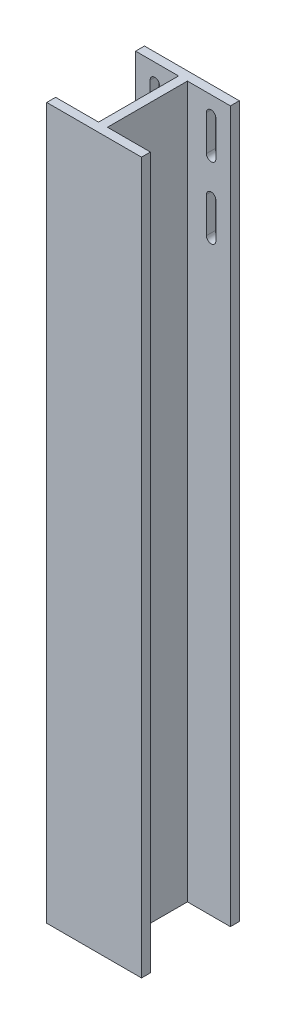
ISO-10303-21;
HEADER;
FILE_DESCRIPTION(('STEP AP214'),'2;1');
FILE_NAME('part.step','',(''),(''),'','','');
FILE_SCHEMA(('AUTOMOTIVE_DESIGN { 1 0 10303 214 1 1 1 1 }'));
ENDSEC;
DATA;
#1=APPLICATION_CONTEXT('core data for automotive mechanical design processes');
#2=APPLICATION_PROTOCOL_DEFINITION('international standard','automotive_design',2000,#1);
#3=PRODUCT_CONTEXT('',#1,'mechanical');
#4=PRODUCT('Part','Part','',(#3));
#5=PRODUCT_RELATED_PRODUCT_CATEGORY('part','',(#4));
#6=PRODUCT_DEFINITION_FORMATION('','',#4);
#7=PRODUCT_DEFINITION_CONTEXT('part definition',#1,'design');
#8=PRODUCT_DEFINITION('design','',#6,#7);
#9=PRODUCT_DEFINITION_SHAPE('','',#8);
#10=(LENGTH_UNIT() NAMED_UNIT(*) SI_UNIT(.MILLI.,.METRE.));
#11=(NAMED_UNIT(*) PLANE_ANGLE_UNIT() SI_UNIT($,.RADIAN.));
#12=(NAMED_UNIT(*) SI_UNIT($,.STERADIAN.) SOLID_ANGLE_UNIT());
#13=UNCERTAINTY_MEASURE_WITH_UNIT(LENGTH_MEASURE(1.E-05),#10,'distance_accuracy_value','');
#14=(GEOMETRIC_REPRESENTATION_CONTEXT(3) GLOBAL_UNCERTAINTY_ASSIGNED_CONTEXT((#13)) GLOBAL_UNIT_ASSIGNED_CONTEXT((#10,
#11,#12)) REPRESENTATION_CONTEXT('',''));
#15=CARTESIAN_POINT('',(0.,0.,0.));
#16=DIRECTION('',(0.,0.,1.));
#17=DIRECTION('',(1.,0.,0.));
#18=AXIS2_PLACEMENT_3D('',#15,#16,#17);
#19=CARTESIAN_POINT('',(0.,762.,0.));
#20=DIRECTION('',(1.,0.,0.));
#21=DIRECTION('',(0.,0.,-1.));
#22=AXIS2_PLACEMENT_3D('',#19,#20,#21);
#23=PLANE('',#22);
#24=DIRECTION('',(0.,0.,1.));
#25=VECTOR('',#24,1.);
#26=CARTESIAN_POINT('',(0.,0.,0.));
#27=LINE('',#26,#25);
#28=CARTESIAN_POINT('',(0.,0.,-9.525));
#29=VERTEX_POINT('',#28);
#30=CARTESIAN_POINT('',(0.,0.,0.));
#31=VERTEX_POINT('',#30);
#32=EDGE_CURVE('E316',#29,#31,#27,.T.);
#33=ORIENTED_EDGE('',*,*,#32,.T.);
#34=DIRECTION('',(0.,-1.,0.));
#35=VECTOR('',#34,1.);
#36=CARTESIAN_POINT('',(0.,762.,0.));
#37=LINE('',#36,#35);
#38=CARTESIAN_POINT('',(0.,762.,0.));
#39=VERTEX_POINT('',#38);
#40=EDGE_CURVE('E395',#39,#31,#37,.T.);
#41=ORIENTED_EDGE('',*,*,#40,.F.);
#42=DIRECTION('',(0.,0.,1.));
#43=VECTOR('',#42,1.);
#44=CARTESIAN_POINT('',(0.,762.,0.));
#45=LINE('',#44,#43);
#46=CARTESIAN_POINT('',(0.,762.,-9.525));
#47=VERTEX_POINT('',#46);
#48=EDGE_CURVE('E266',#47,#39,#45,.T.);
#49=ORIENTED_EDGE('',*,*,#48,.F.);
#50=DIRECTION('',(0.,-1.,0.));
#51=VECTOR('',#50,1.);
#52=CARTESIAN_POINT('',(0.,762.,-9.525));
#53=LINE('',#52,#51);
#54=EDGE_CURVE('E315',#47,#29,#53,.T.);
#55=ORIENTED_EDGE('',*,*,#54,.T.);
#56=EDGE_LOOP('',(#33,#41,#49,#55));
#57=FACE_BOUND('',#56,.T.);
#58=ADVANCED_FACE('F38',(#57),#23,.F.);
#59=CARTESIAN_POINT('',(0.,762.,0.));
#60=DIRECTION('',(0.,0.,-1.));
#61=DIRECTION('',(-1.,0.,0.));
#62=AXIS2_PLACEMENT_3D('',#59,#60,#61);
#63=PLANE('',#62);
#64=DIRECTION('',(1.,0.,0.));
#65=VECTOR('',#64,1.);
#66=CARTESIAN_POINT('',(0.,0.,0.));
#67=LINE('',#66,#65);
#68=CARTESIAN_POINT('',(101.6,0.,0.));
#69=VERTEX_POINT('',#68);
#70=EDGE_CURVE('E115',#31,#69,#67,.T.);
#71=ORIENTED_EDGE('',*,*,#70,.T.);
#72=DIRECTION('',(0.,-1.,0.));
#73=VECTOR('',#72,1.);
#74=CARTESIAN_POINT('',(101.6,762.,0.));
#75=LINE('',#74,#73);
#76=CARTESIAN_POINT('',(101.6,762.,0.));
#77=VERTEX_POINT('',#76);
#78=EDGE_CURVE('E391',#77,#69,#75,.T.);
#79=ORIENTED_EDGE('',*,*,#78,.F.);
#80=DIRECTION('',(1.,0.,0.));
#81=VECTOR('',#80,1.);
#82=CARTESIAN_POINT('',(0.,762.,0.));
#83=LINE('',#82,#81);
#84=EDGE_CURVE('E270',#39,#77,#83,.T.);
#85=ORIENTED_EDGE('',*,*,#84,.F.);
#86=ORIENTED_EDGE('',*,*,#40,.T.);
#87=EDGE_LOOP('',(#71,#79,#85,#86));
#88=FACE_BOUND('',#87,.T.);
#89=ADVANCED_FACE('F511',(#88),#63,.F.);
#90=CARTESIAN_POINT('',(101.6,762.,0.));
#91=DIRECTION('',(-1.,0.,0.));
#92=DIRECTION('',(0.,0.,1.));
#93=AXIS2_PLACEMENT_3D('',#90,#91,#92);
#94=PLANE('',#93);
#95=DIRECTION('',(0.,0.,-1.));
#96=VECTOR('',#95,1.);
#97=CARTESIAN_POINT('',(101.6,0.,0.));
#98=LINE('',#97,#96);
#99=CARTESIAN_POINT('',(101.6,0.,-9.525));
#100=VERTEX_POINT('',#99);
#101=EDGE_CURVE('E323',#69,#100,#98,.T.);
#102=ORIENTED_EDGE('',*,*,#101,.T.);
#103=DIRECTION('',(0.,-1.,0.));
#104=VECTOR('',#103,1.);
#105=CARTESIAN_POINT('',(101.6,762.,-9.525));
#106=LINE('',#105,#104);
#107=CARTESIAN_POINT('',(101.6,762.,-9.525));
#108=VERTEX_POINT('',#107);
#109=EDGE_CURVE('E387',#108,#100,#106,.T.);
#110=ORIENTED_EDGE('',*,*,#109,.F.);
#111=DIRECTION('',(0.,0.,-1.));
#112=VECTOR('',#111,1.);
#113=CARTESIAN_POINT('',(101.6,762.,0.));
#114=LINE('',#113,#112);
#115=EDGE_CURVE('E275',#77,#108,#114,.T.);
#116=ORIENTED_EDGE('',*,*,#115,.F.);
#117=ORIENTED_EDGE('',*,*,#78,.T.);
#118=EDGE_LOOP('',(#102,#110,#116,#117));
#119=FACE_BOUND('',#118,.T.);
#120=ADVANCED_FACE('F518',(#119),#94,.F.);
#121=CARTESIAN_POINT('',(101.6,762.,-9.525));
#122=DIRECTION('',(0.,0.,1.));
#123=DIRECTION('',(1.,0.,0.));
#124=AXIS2_PLACEMENT_3D('',#121,#122,#123);
#125=PLANE('',#124);
#126=DIRECTION('',(-1.,0.,0.));
#127=VECTOR('',#126,1.);
#128=CARTESIAN_POINT('',(101.6,0.,-9.525));
#129=LINE('',#128,#127);
#130=CARTESIAN_POINT('',(55.5625,0.,-9.525));
#131=VERTEX_POINT('',#130);
#132=EDGE_CURVE('E326',#100,#131,#129,.T.);
#133=ORIENTED_EDGE('',*,*,#132,.T.);
#134=DIRECTION('',(0.,-1.,0.));
#135=VECTOR('',#134,1.);
#136=CARTESIAN_POINT('',(55.5625,762.,-9.525));
#137=LINE('',#136,#135);
#138=CARTESIAN_POINT('',(55.5625,762.,-9.525));
#139=VERTEX_POINT('',#138);
#140=EDGE_CURVE('E383',#139,#131,#137,.T.);
#141=ORIENTED_EDGE('',*,*,#140,.F.);
#142=DIRECTION('',(-1.,0.,0.));
#143=VECTOR('',#142,1.);
#144=CARTESIAN_POINT('',(101.6,762.,-9.525));
#145=LINE('',#144,#143);
#146=EDGE_CURVE('E279',#108,#139,#145,.T.);
#147=ORIENTED_EDGE('',*,*,#146,.F.);
#148=ORIENTED_EDGE('',*,*,#109,.T.);
#149=EDGE_LOOP('',(#133,#141,#147,#148));
#150=FACE_BOUND('',#149,.T.);
#151=ADVANCED_FACE('F521',(#150),#125,.F.);
#152=CARTESIAN_POINT('',(55.5625,762.,-9.525));
#153=DIRECTION('',(-1.,0.,0.));
#154=DIRECTION('',(0.,0.,1.));
#155=AXIS2_PLACEMENT_3D('',#152,#153,#154);
#156=PLANE('',#155);
#157=DIRECTION('',(0.,0.,-1.));
#158=VECTOR('',#157,1.);
#159=CARTESIAN_POINT('',(55.5625,0.,-9.525));
#160=LINE('',#159,#158);
#161=CARTESIAN_POINT('',(55.5625,0.,-95.25));
#162=VERTEX_POINT('',#161);
#163=EDGE_CURVE('E329',#131,#162,#160,.T.);
#164=ORIENTED_EDGE('',*,*,#163,.T.);
#165=DIRECTION('',(0.,-1.,0.));
#166=VECTOR('',#165,1.);
#167=CARTESIAN_POINT('',(55.5625,762.,-95.25));
#168=LINE('',#167,#166);
#169=CARTESIAN_POINT('',(55.5625,762.,-95.25));
#170=VERTEX_POINT('',#169);
#171=EDGE_CURVE('E379',#170,#162,#168,.T.);
#172=ORIENTED_EDGE('',*,*,#171,.F.);
#173=DIRECTION('',(0.,0.,-1.));
#174=VECTOR('',#173,1.);
#175=CARTESIAN_POINT('',(55.5625,762.,-9.525));
#176=LINE('',#175,#174);
#177=EDGE_CURVE('E283',#139,#170,#176,.T.);
#178=ORIENTED_EDGE('',*,*,#177,.F.);
#179=ORIENTED_EDGE('',*,*,#140,.T.);
#180=EDGE_LOOP('',(#164,#172,#178,#179));
#181=FACE_BOUND('',#180,.T.);
#182=ADVANCED_FACE('F526',(#181),#156,.F.);
#183=CARTESIAN_POINT('',(101.6,762.,-95.25));
#184=DIRECTION('',(0.,0.,-1.));
#185=DIRECTION('',(-1.,0.,0.));
#186=AXIS2_PLACEMENT_3D('',#183,#184,#185);
#187=PLANE('',#186);
#188=CARTESIAN_POINT('',(80.9625,628.65,-95.25));
#189=DIRECTION('',(0.,0.,-1.));
#190=DIRECTION('',(-1.,0.,0.));
#191=AXIS2_PLACEMENT_3D('',#188,#189,#190);
#192=CIRCLE('',#191,5.04189999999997);
#193=CARTESIAN_POINT('',(75.9206,628.65,-95.25));
#194=VERTEX_POINT('',#193);
#195=CARTESIAN_POINT('',(86.0044,628.65,-95.25));
#196=VERTEX_POINT('',#195);
#197=EDGE_CURVE('E210',#194,#196,#192,.F.);
#198=ORIENTED_EDGE('',*,*,#197,.F.);
#199=DIRECTION('',(0.,-1.,0.));
#200=VECTOR('',#199,1.);
#201=CARTESIAN_POINT('',(75.9206,628.65,-95.25));
#202=LINE('',#201,#200);
#203=CARTESIAN_POINT('',(75.9206,666.75,-95.25));
#204=VERTEX_POINT('',#203);
#205=EDGE_CURVE('E55',#204,#194,#202,.T.);
#206=ORIENTED_EDGE('',*,*,#205,.F.);
#207=CARTESIAN_POINT('',(80.9625,666.75,-95.25));
#208=DIRECTION('',(0.,0.,-1.));
#209=DIRECTION('',(-1.,0.,0.));
#210=AXIS2_PLACEMENT_3D('',#207,#208,#209);
#211=CIRCLE('',#210,5.04189999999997);
#212=CARTESIAN_POINT('',(86.0044,666.75,-95.25));
#213=VERTEX_POINT('',#212);
#214=EDGE_CURVE('E218',#213,#204,#211,.F.);
#215=ORIENTED_EDGE('',*,*,#214,.F.);
#216=DIRECTION('',(0.,1.,0.));
#217=VECTOR('',#216,1.);
#218=CARTESIAN_POINT('',(86.0044,628.65,-95.25));
#219=LINE('',#218,#217);
#220=EDGE_CURVE('E214',#196,#213,#219,.T.);
#221=ORIENTED_EDGE('',*,*,#220,.F.);
#222=EDGE_LOOP('',(#198,#206,#215,#221));
#223=FACE_BOUND('',#222,.T.);
#224=CARTESIAN_POINT('',(80.9625,742.95,-95.25));
#225=DIRECTION('',(0.,0.,-1.));
#226=DIRECTION('',(-1.,0.,0.));
#227=AXIS2_PLACEMENT_3D('',#224,#225,#226);
#228=CIRCLE('',#227,5.04189999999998);
#229=CARTESIAN_POINT('',(86.0044,742.95,-95.25));
#230=VERTEX_POINT('',#229);
#231=CARTESIAN_POINT('',(75.9206,742.95,-95.25));
#232=VERTEX_POINT('',#231);
#233=EDGE_CURVE('E237',#230,#232,#228,.F.);
#234=ORIENTED_EDGE('',*,*,#233,.F.);
#235=DIRECTION('',(0.,1.,0.));
#236=VECTOR('',#235,1.);
#237=CARTESIAN_POINT('',(86.0044,742.95,-95.25));
#238=LINE('',#237,#236);
#239=CARTESIAN_POINT('',(86.0044,704.85,-95.25));
#240=VERTEX_POINT('',#239);
#241=EDGE_CURVE('E234',#240,#230,#238,.T.);
#242=ORIENTED_EDGE('',*,*,#241,.F.);
#243=CARTESIAN_POINT('',(80.9625,704.85,-95.25));
#244=DIRECTION('',(0.,0.,-1.));
#245=DIRECTION('',(-1.,0.,0.));
#246=AXIS2_PLACEMENT_3D('',#243,#244,#245);
#247=CIRCLE('',#246,5.04189999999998);
#248=CARTESIAN_POINT('',(75.9206,704.85,-95.25));
#249=VERTEX_POINT('',#248);
#250=EDGE_CURVE('E246',#249,#240,#247,.F.);
#251=ORIENTED_EDGE('',*,*,#250,.F.);
#252=DIRECTION('',(0.,-1.,0.));
#253=VECTOR('',#252,1.);
#254=CARTESIAN_POINT('',(75.9206,742.95,-95.25));
#255=LINE('',#254,#253);
#256=EDGE_CURVE('E242',#232,#249,#255,.T.);
#257=ORIENTED_EDGE('',*,*,#256,.F.);
#258=EDGE_LOOP('',(#234,#242,#251,#257));
#259=FACE_BOUND('',#258,.T.);
#260=DIRECTION('',(1.,0.,0.));
#261=VECTOR('',#260,1.);
#262=CARTESIAN_POINT('',(101.6,0.,-95.25));
#263=LINE('',#262,#261);
#264=CARTESIAN_POINT('',(101.6,0.,-95.25));
#265=VERTEX_POINT('',#264);
#266=EDGE_CURVE('E332',#162,#265,#263,.T.);
#267=ORIENTED_EDGE('',*,*,#266,.T.);
#268=DIRECTION('',(0.,-1.,0.));
#269=VECTOR('',#268,1.);
#270=CARTESIAN_POINT('',(101.6,762.,-95.25));
#271=LINE('',#270,#269);
#272=CARTESIAN_POINT('',(101.6,762.,-95.25));
#273=VERTEX_POINT('',#272);
#274=EDGE_CURVE('E375',#273,#265,#271,.T.);
#275=ORIENTED_EDGE('',*,*,#274,.F.);
#276=DIRECTION('',(1.,0.,0.));
#277=VECTOR('',#276,1.);
#278=CARTESIAN_POINT('',(101.6,762.,-95.25));
#279=LINE('',#278,#277);
#280=EDGE_CURVE('E287',#170,#273,#279,.T.);
#281=ORIENTED_EDGE('',*,*,#280,.F.);
#282=ORIENTED_EDGE('',*,*,#171,.T.);
#283=EDGE_LOOP('',(#267,#275,#281,#282));
#284=FACE_BOUND('',#283,.T.);
#285=ADVANCED_FACE('F464',(#223,#259,#284),#187,.F.);
#286=CARTESIAN_POINT('',(101.6,762.,-104.775));
#287=DIRECTION('',(-1.,0.,0.));
#288=DIRECTION('',(0.,0.,1.));
#289=AXIS2_PLACEMENT_3D('',#286,#287,#288);
#290=PLANE('',#289);
#291=DIRECTION('',(0.,0.,-1.));
#292=VECTOR('',#291,1.);
#293=CARTESIAN_POINT('',(101.6,0.,-104.775));
#294=LINE('',#293,#292);
#295=CARTESIAN_POINT('',(101.6,0.,-104.775));
#296=VERTEX_POINT('',#295);
#297=EDGE_CURVE('E335',#265,#296,#294,.T.);
#298=ORIENTED_EDGE('',*,*,#297,.T.);
#299=DIRECTION('',(0.,-1.,0.));
#300=VECTOR('',#299,1.);
#301=CARTESIAN_POINT('',(101.6,762.,-104.775));
#302=LINE('',#301,#300);
#303=CARTESIAN_POINT('',(101.6,762.,-104.775));
#304=VERTEX_POINT('',#303);
#305=EDGE_CURVE('E371',#304,#296,#302,.T.);
#306=ORIENTED_EDGE('',*,*,#305,.F.);
#307=DIRECTION('',(0.,0.,-1.));
#308=VECTOR('',#307,1.);
#309=CARTESIAN_POINT('',(101.6,762.,-104.775));
#310=LINE('',#309,#308);
#311=EDGE_CURVE('E291',#273,#304,#310,.T.);
#312=ORIENTED_EDGE('',*,*,#311,.F.);
#313=ORIENTED_EDGE('',*,*,#274,.T.);
#314=EDGE_LOOP('',(#298,#306,#312,#313));
#315=FACE_BOUND('',#314,.T.);
#316=ADVANCED_FACE('F535',(#315),#290,.F.);
#317=CARTESIAN_POINT('',(0.,762.,-104.775));
#318=DIRECTION('',(0.,0.,1.));
#319=DIRECTION('',(1.,0.,0.));
#320=AXIS2_PLACEMENT_3D('',#317,#318,#319);
#321=PLANE('',#320);
#322=CARTESIAN_POINT('',(80.9625,666.75,-104.775));
#323=DIRECTION('',(0.,0.,-1.));
#324=DIRECTION('',(-1.,0.,0.));
#325=AXIS2_PLACEMENT_3D('',#322,#323,#324);
#326=CIRCLE('',#325,5.04189999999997);
#327=CARTESIAN_POINT('',(86.0044,666.75,-104.775));
#328=VERTEX_POINT('',#327);
#329=CARTESIAN_POINT('',(75.9206,666.75,-104.775));
#330=VERTEX_POINT('',#329);
#331=EDGE_CURVE('E47',#328,#330,#326,.F.);
#332=ORIENTED_EDGE('',*,*,#331,.T.);
#333=DIRECTION('',(0.,1.,0.));
#334=VECTOR('',#333,1.);
#335=CARTESIAN_POINT('',(75.9206,762.,-104.775));
#336=LINE('',#335,#334);
#337=CARTESIAN_POINT('',(75.9206,628.65,-104.775));
#338=VERTEX_POINT('',#337);
#339=EDGE_CURVE('E11',#330,#338,#336,.F.);
#340=ORIENTED_EDGE('',*,*,#339,.T.);
#341=CARTESIAN_POINT('',(80.9625,628.65,-104.775));
#342=DIRECTION('',(0.,0.,-1.));
#343=DIRECTION('',(-1.,0.,0.));
#344=AXIS2_PLACEMENT_3D('',#341,#342,#343);
#345=CIRCLE('',#344,5.04189999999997);
#346=CARTESIAN_POINT('',(86.0044,628.65,-104.775));
#347=VERTEX_POINT('',#346);
#348=EDGE_CURVE('E414',#338,#347,#345,.F.);
#349=ORIENTED_EDGE('',*,*,#348,.T.);
#350=DIRECTION('',(0.,1.,0.));
#351=VECTOR('',#350,1.);
#352=CARTESIAN_POINT('',(86.0044,762.,-104.775));
#353=LINE('',#352,#351);
#354=EDGE_CURVE('E441',#347,#328,#353,.T.);
#355=ORIENTED_EDGE('',*,*,#354,.T.);
#356=EDGE_LOOP('',(#332,#340,#349,#355));
#357=FACE_BOUND('',#356,.T.);
#358=DIRECTION('',(0.,1.,0.));
#359=VECTOR('',#358,1.);
#360=CARTESIAN_POINT('',(15.5956,628.65,-104.775));
#361=LINE('',#360,#359);
#362=CARTESIAN_POINT('',(15.5956,628.65,-104.775));
#363=VERTEX_POINT('',#362);
#364=CARTESIAN_POINT('',(15.5956,666.75,-104.775));
#365=VERTEX_POINT('',#364);
#366=EDGE_CURVE('E183',#363,#365,#361,.T.);
#367=ORIENTED_EDGE('',*,*,#366,.F.);
#368=CARTESIAN_POINT('',(20.6375,628.65,-104.775));
#369=DIRECTION('',(0.,0.,-1.));
#370=DIRECTION('',(-1.,0.,0.));
#371=AXIS2_PLACEMENT_3D('',#368,#369,#370);
#372=CIRCLE('',#371,5.0419);
#373=CARTESIAN_POINT('',(25.6794,628.65,-104.775));
#374=VERTEX_POINT('',#373);
#375=EDGE_CURVE('E320',#374,#363,#372,.T.);
#376=ORIENTED_EDGE('',*,*,#375,.F.);
#377=DIRECTION('',(0.,1.,0.));
#378=VECTOR('',#377,1.);
#379=CARTESIAN_POINT('',(25.6794,628.65,-104.775));
#380=LINE('',#379,#378);
#381=CARTESIAN_POINT('',(25.6794,666.75,-104.775));
#382=VERTEX_POINT('',#381);
#383=EDGE_CURVE('E432',#382,#374,#380,.F.);
#384=ORIENTED_EDGE('',*,*,#383,.F.);
#385=CARTESIAN_POINT('',(20.6375,666.75,-104.775));
#386=DIRECTION('',(0.,0.,-1.));
#387=DIRECTION('',(-1.,0.,0.));
#388=AXIS2_PLACEMENT_3D('',#385,#386,#387);
#389=CIRCLE('',#388,5.0419);
#390=EDGE_CURVE('E429',#365,#382,#389,.T.);
#391=ORIENTED_EDGE('',*,*,#390,.F.);
#392=EDGE_LOOP('',(#367,#376,#384,#391));
#393=FACE_BOUND('',#392,.T.);
#394=DIRECTION('',(0.,1.,0.));
#395=VECTOR('',#394,1.);
#396=CARTESIAN_POINT('',(15.5956,704.85,-104.775));
#397=LINE('',#396,#395);
#398=CARTESIAN_POINT('',(15.5956,704.85,-104.775));
#399=VERTEX_POINT('',#398);
#400=CARTESIAN_POINT('',(15.5956,742.95,-104.775));
#401=VERTEX_POINT('',#400);
#402=EDGE_CURVE('E255',#399,#401,#397,.T.);
#403=ORIENTED_EDGE('',*,*,#402,.F.);
#404=CARTESIAN_POINT('',(20.6375,704.85,-104.775));
#405=DIRECTION('',(0.,0.,-1.));
#406=DIRECTION('',(-1.,0.,0.));
#407=AXIS2_PLACEMENT_3D('',#404,#405,#406);
#408=CIRCLE('',#407,5.0419);
#409=CARTESIAN_POINT('',(25.6794,704.85,-104.775));
#410=VERTEX_POINT('',#409);
#411=EDGE_CURVE('E423',#410,#399,#408,.T.);
#412=ORIENTED_EDGE('',*,*,#411,.F.);
#413=DIRECTION('',(0.,1.,0.));
#414=VECTOR('',#413,1.);
#415=CARTESIAN_POINT('',(25.6794,704.85,-104.775));
#416=LINE('',#415,#414);
#417=CARTESIAN_POINT('',(25.6794,742.95,-104.775));
#418=VERTEX_POINT('',#417);
#419=EDGE_CURVE('E420',#418,#410,#416,.F.);
#420=ORIENTED_EDGE('',*,*,#419,.F.);
#421=CARTESIAN_POINT('',(20.6375,742.95,-104.775));
#422=DIRECTION('',(0.,0.,-1.));
#423=DIRECTION('',(-1.,0.,0.));
#424=AXIS2_PLACEMENT_3D('',#421,#422,#423);
#425=CIRCLE('',#424,5.0419);
#426=EDGE_CURVE('E417',#401,#418,#425,.T.);
#427=ORIENTED_EDGE('',*,*,#426,.F.);
#428=EDGE_LOOP('',(#403,#412,#420,#427));
#429=FACE_BOUND('',#428,.T.);
#430=CARTESIAN_POINT('',(80.9625,704.85,-104.775));
#431=DIRECTION('',(0.,0.,-1.));
#432=DIRECTION('',(-1.,0.,0.));
#433=AXIS2_PLACEMENT_3D('',#430,#431,#432);
#434=CIRCLE('',#433,5.04189999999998);
#435=CARTESIAN_POINT('',(75.9206,704.85,-104.775));
#436=VERTEX_POINT('',#435);
#437=CARTESIAN_POINT('',(86.0044,704.85,-104.775));
#438=VERTEX_POINT('',#437);
#439=EDGE_CURVE('E406',#436,#438,#434,.F.);
#440=ORIENTED_EDGE('',*,*,#439,.T.);
#441=DIRECTION('',(0.,1.,0.));
#442=VECTOR('',#441,1.);
#443=CARTESIAN_POINT('',(86.0044,762.,-104.775));
#444=LINE('',#443,#442);
#445=CARTESIAN_POINT('',(86.0044,742.95,-104.775));
#446=VERTEX_POINT('',#445);
#447=EDGE_CURVE('E410',#438,#446,#444,.T.);
#448=ORIENTED_EDGE('',*,*,#447,.T.);
#449=CARTESIAN_POINT('',(80.9625,742.95,-104.775));
#450=DIRECTION('',(0.,0.,-1.));
#451=DIRECTION('',(-1.,0.,0.));
#452=AXIS2_PLACEMENT_3D('',#449,#450,#451);
#453=CIRCLE('',#452,5.04189999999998);
#454=CARTESIAN_POINT('',(75.9206,742.95,-104.775));
#455=VERTEX_POINT('',#454);
#456=EDGE_CURVE('E398',#446,#455,#453,.F.);
#457=ORIENTED_EDGE('',*,*,#456,.T.);
#458=DIRECTION('',(0.,1.,0.));
#459=VECTOR('',#458,1.);
#460=CARTESIAN_POINT('',(75.9206,762.,-104.775));
#461=LINE('',#460,#459);
#462=EDGE_CURVE('E402',#455,#436,#461,.F.);
#463=ORIENTED_EDGE('',*,*,#462,.T.);
#464=EDGE_LOOP('',(#440,#448,#457,#463));
#465=FACE_BOUND('',#464,.T.);
#466=DIRECTION('',(-1.,0.,0.));
#467=VECTOR('',#466,1.);
#468=CARTESIAN_POINT('',(0.,0.,-104.775));
#469=LINE('',#468,#467);
#470=CARTESIAN_POINT('',(0.,0.,-104.775));
#471=VERTEX_POINT('',#470);
#472=EDGE_CURVE('E338',#296,#471,#469,.T.);
#473=ORIENTED_EDGE('',*,*,#472,.T.);
#474=DIRECTION('',(0.,-1.,0.));
#475=VECTOR('',#474,1.);
#476=CARTESIAN_POINT('',(0.,762.,-104.775));
#477=LINE('',#476,#475);
#478=CARTESIAN_POINT('',(0.,762.,-104.775));
#479=VERTEX_POINT('',#478);
#480=EDGE_CURVE('E367',#479,#471,#477,.T.);
#481=ORIENTED_EDGE('',*,*,#480,.F.);
#482=DIRECTION('',(-1.,0.,0.));
#483=VECTOR('',#482,1.);
#484=CARTESIAN_POINT('',(0.,762.,-104.775));
#485=LINE('',#484,#483);
#486=EDGE_CURVE('E295',#304,#479,#485,.T.);
#487=ORIENTED_EDGE('',*,*,#486,.F.);
#488=ORIENTED_EDGE('',*,*,#305,.T.);
#489=EDGE_LOOP('',(#473,#481,#487,#488));
#490=FACE_BOUND('',#489,.T.);
#491=ADVANCED_FACE('F447',(#357,#393,#429,#465,#490),#321,.F.);
#492=CARTESIAN_POINT('',(0.,762.,-104.775));
#493=DIRECTION('',(1.,0.,0.));
#494=DIRECTION('',(0.,0.,-1.));
#495=AXIS2_PLACEMENT_3D('',#492,#493,#494);
#496=PLANE('',#495);
#497=DIRECTION('',(0.,0.,1.));
#498=VECTOR('',#497,1.);
#499=CARTESIAN_POINT('',(0.,0.,-104.775));
#500=LINE('',#499,#498);
#501=CARTESIAN_POINT('',(0.,0.,-95.25));
#502=VERTEX_POINT('',#501);
#503=EDGE_CURVE('E341',#471,#502,#500,.T.);
#504=ORIENTED_EDGE('',*,*,#503,.T.);
#505=DIRECTION('',(0.,-1.,0.));
#506=VECTOR('',#505,1.);
#507=CARTESIAN_POINT('',(0.,762.,-95.25));
#508=LINE('',#507,#506);
#509=CARTESIAN_POINT('',(0.,762.,-95.25));
#510=VERTEX_POINT('',#509);
#511=EDGE_CURVE('E363',#510,#502,#508,.T.);
#512=ORIENTED_EDGE('',*,*,#511,.F.);
#513=DIRECTION('',(0.,0.,1.));
#514=VECTOR('',#513,1.);
#515=CARTESIAN_POINT('',(0.,762.,-104.775));
#516=LINE('',#515,#514);
#517=EDGE_CURVE('E299',#479,#510,#516,.T.);
#518=ORIENTED_EDGE('',*,*,#517,.F.);
#519=ORIENTED_EDGE('',*,*,#480,.T.);
#520=EDGE_LOOP('',(#504,#512,#518,#519));
#521=FACE_BOUND('',#520,.T.);
#522=ADVANCED_FACE('F545',(#521),#496,.F.);
#523=CARTESIAN_POINT('',(0.,762.,-95.25));
#524=DIRECTION('',(0.,0.,-1.));
#525=DIRECTION('',(-1.,0.,0.));
#526=AXIS2_PLACEMENT_3D('',#523,#524,#525);
#527=PLANE('',#526);
#528=DIRECTION('',(0.,1.,0.));
#529=VECTOR('',#528,1.);
#530=CARTESIAN_POINT('',(25.6794,628.65,-95.25));
#531=LINE('',#530,#529);
#532=CARTESIAN_POINT('',(25.6794,628.65,-95.25));
#533=VERTEX_POINT('',#532);
#534=CARTESIAN_POINT('',(25.6794,666.75,-95.25));
#535=VERTEX_POINT('',#534);
#536=EDGE_CURVE('E173',#533,#535,#531,.T.);
#537=ORIENTED_EDGE('',*,*,#536,.F.);
#538=CARTESIAN_POINT('',(20.6375,628.65,-95.25));
#539=DIRECTION('',(0.,0.,-1.));
#540=DIRECTION('',(-1.,0.,0.));
#541=AXIS2_PLACEMENT_3D('',#538,#539,#540);
#542=CIRCLE('',#541,5.0419);
#543=CARTESIAN_POINT('',(15.5956,628.65,-95.25));
#544=VERTEX_POINT('',#543);
#545=EDGE_CURVE('E190',#544,#533,#542,.F.);
#546=ORIENTED_EDGE('',*,*,#545,.F.);
#547=DIRECTION('',(0.,-1.,0.));
#548=VECTOR('',#547,1.);
#549=CARTESIAN_POINT('',(15.5956,628.65,-95.25));
#550=LINE('',#549,#548);
#551=CARTESIAN_POINT('',(15.5956,666.75,-95.25));
#552=VERTEX_POINT('',#551);
#553=EDGE_CURVE('E180',#552,#544,#550,.T.);
#554=ORIENTED_EDGE('',*,*,#553,.F.);
#555=CARTESIAN_POINT('',(20.6375,666.75,-95.25));
#556=DIRECTION('',(0.,0.,-1.));
#557=DIRECTION('',(-1.,0.,0.));
#558=AXIS2_PLACEMENT_3D('',#555,#556,#557);
#559=CIRCLE('',#558,5.0419);
#560=EDGE_CURVE('E160',#535,#552,#559,.F.);
#561=ORIENTED_EDGE('',*,*,#560,.F.);
#562=EDGE_LOOP('',(#537,#546,#554,#561));
#563=FACE_BOUND('',#562,.T.);
#564=DIRECTION('',(0.,1.,0.));
#565=VECTOR('',#564,1.);
#566=CARTESIAN_POINT('',(25.6794,704.85,-95.25));
#567=LINE('',#566,#565);
#568=CARTESIAN_POINT('',(25.6794,704.85,-95.25));
#569=VERTEX_POINT('',#568);
#570=CARTESIAN_POINT('',(25.6794,742.95,-95.25));
#571=VERTEX_POINT('',#570);
#572=EDGE_CURVE('E197',#569,#571,#567,.T.);
#573=ORIENTED_EDGE('',*,*,#572,.F.);
#574=CARTESIAN_POINT('',(20.6375,704.85,-95.25));
#575=DIRECTION('',(0.,0.,-1.));
#576=DIRECTION('',(-1.,0.,0.));
#577=AXIS2_PLACEMENT_3D('',#574,#575,#576);
#578=CIRCLE('',#577,5.0419);
#579=CARTESIAN_POINT('',(15.5956,704.85,-95.25));
#580=VERTEX_POINT('',#579);
#581=EDGE_CURVE('E784',#580,#569,#578,.F.);
#582=ORIENTED_EDGE('',*,*,#581,.F.);
#583=DIRECTION('',(0.,-1.,0.));
#584=VECTOR('',#583,1.);
#585=CARTESIAN_POINT('',(15.5956,704.85,-95.25));
#586=LINE('',#585,#584);
#587=CARTESIAN_POINT('',(15.5956,742.95,-95.25));
#588=VERTEX_POINT('',#587);
#589=EDGE_CURVE('E238',#588,#580,#586,.T.);
#590=ORIENTED_EDGE('',*,*,#589,.F.);
#591=CARTESIAN_POINT('',(20.6375,742.95,-95.25));
#592=DIRECTION('',(0.,0.,-1.));
#593=DIRECTION('',(-1.,0.,0.));
#594=AXIS2_PLACEMENT_3D('',#591,#592,#593);
#595=CIRCLE('',#594,5.0419);
#596=EDGE_CURVE('E192',#571,#588,#595,.F.);
#597=ORIENTED_EDGE('',*,*,#596,.F.);
#598=EDGE_LOOP('',(#573,#582,#590,#597));
#599=FACE_BOUND('',#598,.T.);
#600=DIRECTION('',(1.,0.,0.));
#601=VECTOR('',#600,1.);
#602=CARTESIAN_POINT('',(0.,0.,-95.25));
#603=LINE('',#602,#601);
#604=CARTESIAN_POINT('',(46.0375,0.,-95.25));
#605=VERTEX_POINT('',#604);
#606=EDGE_CURVE('E344',#502,#605,#603,.T.);
#607=ORIENTED_EDGE('',*,*,#606,.T.);
#608=DIRECTION('',(0.,-1.,0.));
#609=VECTOR('',#608,1.);
#610=CARTESIAN_POINT('',(46.0375,762.,-95.25));
#611=LINE('',#610,#609);
#612=CARTESIAN_POINT('',(46.0375,762.,-95.25));
#613=VERTEX_POINT('',#612);
#614=EDGE_CURVE('E359',#613,#605,#611,.T.);
#615=ORIENTED_EDGE('',*,*,#614,.F.);
#616=DIRECTION('',(1.,0.,0.));
#617=VECTOR('',#616,1.);
#618=CARTESIAN_POINT('',(0.,762.,-95.25));
#619=LINE('',#618,#617);
#620=EDGE_CURVE('E303',#510,#613,#619,.T.);
#621=ORIENTED_EDGE('',*,*,#620,.F.);
#622=ORIENTED_EDGE('',*,*,#511,.T.);
#623=EDGE_LOOP('',(#607,#615,#621,#622));
#624=FACE_BOUND('',#623,.T.);
#625=ADVANCED_FACE('F187',(#563,#599,#624),#527,.F.);
#626=CARTESIAN_POINT('',(46.0375,762.,-95.25));
#627=DIRECTION('',(1.,0.,0.));
#628=DIRECTION('',(0.,0.,-1.));
#629=AXIS2_PLACEMENT_3D('',#626,#627,#628);
#630=PLANE('',#629);
#631=DIRECTION('',(0.,0.,1.));
#632=VECTOR('',#631,1.);
#633=CARTESIAN_POINT('',(46.0375,0.,-95.25));
#634=LINE('',#633,#632);
#635=CARTESIAN_POINT('',(46.0375,0.,-9.525));
#636=VERTEX_POINT('',#635);
#637=EDGE_CURVE('E347',#605,#636,#634,.T.);
#638=ORIENTED_EDGE('',*,*,#637,.T.);
#639=DIRECTION('',(0.,-1.,0.));
#640=VECTOR('',#639,1.);
#641=CARTESIAN_POINT('',(46.0375,762.,-9.525));
#642=LINE('',#641,#640);
#643=CARTESIAN_POINT('',(46.0375,762.,-9.525));
#644=VERTEX_POINT('',#643);
#645=EDGE_CURVE('E355',#644,#636,#642,.T.);
#646=ORIENTED_EDGE('',*,*,#645,.F.);
#647=DIRECTION('',(0.,0.,1.));
#648=VECTOR('',#647,1.);
#649=CARTESIAN_POINT('',(46.0375,762.,-95.25));
#650=LINE('',#649,#648);
#651=EDGE_CURVE('E307',#613,#644,#650,.T.);
#652=ORIENTED_EDGE('',*,*,#651,.F.);
#653=ORIENTED_EDGE('',*,*,#614,.T.);
#654=EDGE_LOOP('',(#638,#646,#652,#653));
#655=FACE_BOUND('',#654,.T.);
#656=ADVANCED_FACE('F551',(#655),#630,.F.);
#657=CARTESIAN_POINT('',(0.,762.,-9.525));
#658=DIRECTION('',(0.,0.,1.));
#659=DIRECTION('',(1.,0.,0.));
#660=AXIS2_PLACEMENT_3D('',#657,#658,#659);
#661=PLANE('',#660);
#662=DIRECTION('',(-1.,0.,0.));
#663=VECTOR('',#662,1.);
#664=CARTESIAN_POINT('',(0.,0.,-9.525));
#665=LINE('',#664,#663);
#666=EDGE_CURVE('E271',#636,#29,#665,.T.);
#667=ORIENTED_EDGE('',*,*,#666,.T.);
#668=ORIENTED_EDGE('',*,*,#54,.F.);
#669=DIRECTION('',(-1.,0.,0.));
#670=VECTOR('',#669,1.);
#671=CARTESIAN_POINT('',(0.,762.,-9.525));
#672=LINE('',#671,#670);
#673=EDGE_CURVE('E311',#644,#47,#672,.T.);
#674=ORIENTED_EDGE('',*,*,#673,.F.);
#675=ORIENTED_EDGE('',*,*,#645,.T.);
#676=EDGE_LOOP('',(#667,#668,#674,#675));
#677=FACE_BOUND('',#676,.T.);
#678=ADVANCED_FACE('F507',(#677),#661,.F.);
#679=CARTESIAN_POINT('',(0.,762.,0.));
#680=DIRECTION('',(0.,-1.,0.));
#681=DIRECTION('',(0.,0.,-1.));
#682=AXIS2_PLACEMENT_3D('',#679,#680,#681);
#683=PLANE('',#682);
#684=ORIENTED_EDGE('',*,*,#48,.T.);
#685=ORIENTED_EDGE('',*,*,#84,.T.);
#686=ORIENTED_EDGE('',*,*,#115,.T.);
#687=ORIENTED_EDGE('',*,*,#146,.T.);
#688=ORIENTED_EDGE('',*,*,#177,.T.);
#689=ORIENTED_EDGE('',*,*,#280,.T.);
#690=ORIENTED_EDGE('',*,*,#311,.T.);
#691=ORIENTED_EDGE('',*,*,#486,.T.);
#692=ORIENTED_EDGE('',*,*,#517,.T.);
#693=ORIENTED_EDGE('',*,*,#620,.T.);
#694=ORIENTED_EDGE('',*,*,#651,.T.);
#695=ORIENTED_EDGE('',*,*,#673,.T.);
#696=EDGE_LOOP('',(#684,#685,#686,#687,#688,#689,#690,#691,#692,#693,#694,#695));
#697=FACE_BOUND('',#696,.T.);
#698=ADVANCED_FACE('F503',(#697),#683,.F.);
#699=CARTESIAN_POINT('',(0.,0.,0.));
#700=DIRECTION('',(0.,-1.,0.));
#701=DIRECTION('',(0.,0.,-1.));
#702=AXIS2_PLACEMENT_3D('',#699,#700,#701);
#703=PLANE('',#702);
#704=ORIENTED_EDGE('',*,*,#32,.F.);
#705=ORIENTED_EDGE('',*,*,#666,.F.);
#706=ORIENTED_EDGE('',*,*,#637,.F.);
#707=ORIENTED_EDGE('',*,*,#606,.F.);
#708=ORIENTED_EDGE('',*,*,#503,.F.);
#709=ORIENTED_EDGE('',*,*,#472,.F.);
#710=ORIENTED_EDGE('',*,*,#297,.F.);
#711=ORIENTED_EDGE('',*,*,#266,.F.);
#712=ORIENTED_EDGE('',*,*,#163,.F.);
#713=ORIENTED_EDGE('',*,*,#132,.F.);
#714=ORIENTED_EDGE('',*,*,#101,.F.);
#715=ORIENTED_EDGE('',*,*,#70,.F.);
#716=EDGE_LOOP('',(#704,#705,#706,#707,#708,#709,#710,#711,#712,#713,#714,#715));
#717=FACE_BOUND('',#716,.T.);
#718=ADVANCED_FACE('F552',(#717),#703,.T.);
#719=CARTESIAN_POINT('',(20.6375,704.85,0.001000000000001));
#720=DIRECTION('',(0.,0.,-1.));
#721=DIRECTION('',(-1.,0.,0.));
#722=AXIS2_PLACEMENT_3D('',#719,#720,#721);
#723=CYLINDRICAL_SURFACE('',#722,5.0419);
#724=DIRECTION('',(0.,0.,-1.));
#725=VECTOR('',#724,1.);
#726=CARTESIAN_POINT('',(15.5956,704.85,0.001000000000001));
#727=LINE('',#726,#725);
#728=EDGE_CURVE('E780',#580,#399,#727,.T.);
#729=ORIENTED_EDGE('',*,*,#728,.F.);
#730=ORIENTED_EDGE('',*,*,#581,.T.);
#731=DIRECTION('',(0.,0.,-1.));
#732=VECTOR('',#731,1.);
#733=CARTESIAN_POINT('',(25.6794,704.85,0.001000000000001));
#734=LINE('',#733,#732);
#735=EDGE_CURVE('E796',#569,#410,#734,.T.);
#736=ORIENTED_EDGE('',*,*,#735,.T.);
#737=ORIENTED_EDGE('',*,*,#411,.T.);
#738=EDGE_LOOP('',(#729,#730,#736,#737));
#739=FACE_BOUND('',#738,.T.);
#740=ADVANCED_FACE('F554',(#739),#723,.F.);
#741=CARTESIAN_POINT('',(25.6794,704.85,0.001000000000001));
#742=DIRECTION('',(1.,0.,0.));
#743=DIRECTION('',(0.,0.,-1.));
#744=AXIS2_PLACEMENT_3D('',#741,#742,#743);
#745=PLANE('',#744);
#746=ORIENTED_EDGE('',*,*,#735,.F.);
#747=ORIENTED_EDGE('',*,*,#572,.T.);
#748=DIRECTION('',(0.,0.,-1.));
#749=VECTOR('',#748,1.);
#750=CARTESIAN_POINT('',(25.6794,742.95,0.001000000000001));
#751=LINE('',#750,#749);
#752=EDGE_CURVE('E806',#571,#418,#751,.T.);
#753=ORIENTED_EDGE('',*,*,#752,.T.);
#754=ORIENTED_EDGE('',*,*,#419,.T.);
#755=EDGE_LOOP('',(#746,#747,#753,#754));
#756=FACE_BOUND('',#755,.T.);
#757=ADVANCED_FACE('F560',(#756),#745,.F.);
#758=CARTESIAN_POINT('',(20.6375,742.95,0.001000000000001));
#759=DIRECTION('',(0.,0.,-1.));
#760=DIRECTION('',(-1.,0.,0.));
#761=AXIS2_PLACEMENT_3D('',#758,#759,#760);
#762=CYLINDRICAL_SURFACE('',#761,5.0419);
#763=ORIENTED_EDGE('',*,*,#752,.F.);
#764=ORIENTED_EDGE('',*,*,#596,.T.);
#765=DIRECTION('',(0.,0.,-1.));
#766=VECTOR('',#765,1.);
#767=CARTESIAN_POINT('',(15.5956,742.95,0.001000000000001));
#768=LINE('',#767,#766);
#769=EDGE_CURVE('E789',#588,#401,#768,.T.);
#770=ORIENTED_EDGE('',*,*,#769,.T.);
#771=ORIENTED_EDGE('',*,*,#426,.T.);
#772=EDGE_LOOP('',(#763,#764,#770,#771));
#773=FACE_BOUND('',#772,.T.);
#774=ADVANCED_FACE('F629',(#773),#762,.F.);
#775=CARTESIAN_POINT('',(15.5956,704.85,0.001000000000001));
#776=DIRECTION('',(-1.,0.,0.));
#777=DIRECTION('',(0.,0.,1.));
#778=AXIS2_PLACEMENT_3D('',#775,#776,#777);
#779=PLANE('',#778);
#780=ORIENTED_EDGE('',*,*,#769,.F.);
#781=ORIENTED_EDGE('',*,*,#589,.T.);
#782=ORIENTED_EDGE('',*,*,#728,.T.);
#783=ORIENTED_EDGE('',*,*,#402,.T.);
#784=EDGE_LOOP('',(#780,#781,#782,#783));
#785=FACE_BOUND('',#784,.T.);
#786=ADVANCED_FACE('F639',(#785),#779,.F.);
#787=CARTESIAN_POINT('',(20.6375,628.65,0.001000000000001));
#788=DIRECTION('',(0.,0.,-1.));
#789=DIRECTION('',(-1.,0.,0.));
#790=AXIS2_PLACEMENT_3D('',#787,#788,#789);
#791=CYLINDRICAL_SURFACE('',#790,5.0419);
#792=DIRECTION('',(0.,0.,-1.));
#793=VECTOR('',#792,1.);
#794=CARTESIAN_POINT('',(15.5956,628.65,0.001000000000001));
#795=LINE('',#794,#793);
#796=EDGE_CURVE('E185',#544,#363,#795,.T.);
#797=ORIENTED_EDGE('',*,*,#796,.F.);
#798=ORIENTED_EDGE('',*,*,#545,.T.);
#799=DIRECTION('',(0.,0.,-1.));
#800=VECTOR('',#799,1.);
#801=CARTESIAN_POINT('',(25.6794,628.65,0.001000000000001));
#802=LINE('',#801,#800);
#803=EDGE_CURVE('E193',#533,#374,#802,.T.);
#804=ORIENTED_EDGE('',*,*,#803,.T.);
#805=ORIENTED_EDGE('',*,*,#375,.T.);
#806=EDGE_LOOP('',(#797,#798,#804,#805));
#807=FACE_BOUND('',#806,.T.);
#808=ADVANCED_FACE('F649',(#807),#791,.F.);
#809=CARTESIAN_POINT('',(25.6794,628.65,0.001000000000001));
#810=DIRECTION('',(1.,0.,0.));
#811=DIRECTION('',(0.,0.,-1.));
#812=AXIS2_PLACEMENT_3D('',#809,#810,#811);
#813=PLANE('',#812);
#814=ORIENTED_EDGE('',*,*,#803,.F.);
#815=ORIENTED_EDGE('',*,*,#536,.T.);
#816=DIRECTION('',(0.,0.,-1.));
#817=VECTOR('',#816,1.);
#818=CARTESIAN_POINT('',(25.6794,666.75,0.001000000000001));
#819=LINE('',#818,#817);
#820=EDGE_CURVE('E167',#535,#382,#819,.T.);
#821=ORIENTED_EDGE('',*,*,#820,.T.);
#822=ORIENTED_EDGE('',*,*,#383,.T.);
#823=EDGE_LOOP('',(#814,#815,#821,#822));
#824=FACE_BOUND('',#823,.T.);
#825=ADVANCED_FACE('F659',(#824),#813,.F.);
#826=CARTESIAN_POINT('',(20.6375,666.75,0.001000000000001));
#827=DIRECTION('',(0.,0.,-1.));
#828=DIRECTION('',(-1.,0.,0.));
#829=AXIS2_PLACEMENT_3D('',#826,#827,#828);
#830=CYLINDRICAL_SURFACE('',#829,5.0419);
#831=ORIENTED_EDGE('',*,*,#820,.F.);
#832=ORIENTED_EDGE('',*,*,#560,.T.);
#833=DIRECTION('',(0.,0.,-1.));
#834=VECTOR('',#833,1.);
#835=CARTESIAN_POINT('',(15.5956,666.75,0.001000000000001));
#836=LINE('',#835,#834);
#837=EDGE_CURVE('E163',#552,#365,#836,.T.);
#838=ORIENTED_EDGE('',*,*,#837,.T.);
#839=ORIENTED_EDGE('',*,*,#390,.T.);
#840=EDGE_LOOP('',(#831,#832,#838,#839));
#841=FACE_BOUND('',#840,.T.);
#842=ADVANCED_FACE('F162',(#841),#830,.F.);
#843=CARTESIAN_POINT('',(15.5956,628.65,0.001000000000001));
#844=DIRECTION('',(-1.,0.,0.));
#845=DIRECTION('',(0.,0.,1.));
#846=AXIS2_PLACEMENT_3D('',#843,#844,#845);
#847=PLANE('',#846);
#848=ORIENTED_EDGE('',*,*,#837,.F.);
#849=ORIENTED_EDGE('',*,*,#553,.T.);
#850=ORIENTED_EDGE('',*,*,#796,.T.);
#851=ORIENTED_EDGE('',*,*,#366,.T.);
#852=EDGE_LOOP('',(#848,#849,#850,#851));
#853=FACE_BOUND('',#852,.T.);
#854=ADVANCED_FACE('F178',(#853),#847,.F.);
#855=CARTESIAN_POINT('',(86.0044,742.95,0.001000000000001));
#856=DIRECTION('',(1.,0.,0.));
#857=DIRECTION('',(0.,0.,-1.));
#858=AXIS2_PLACEMENT_3D('',#855,#856,#857);
#859=PLANE('',#858);
#860=DIRECTION('',(0.,0.,-1.));
#861=VECTOR('',#860,1.);
#862=CARTESIAN_POINT('',(86.0044,704.85,0.001000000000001));
#863=LINE('',#862,#861);
#864=EDGE_CURVE('E250',#240,#438,#863,.T.);
#865=ORIENTED_EDGE('',*,*,#864,.F.);
#866=ORIENTED_EDGE('',*,*,#241,.T.);
#867=DIRECTION('',(0.,0.,-1.));
#868=VECTOR('',#867,1.);
#869=CARTESIAN_POINT('',(86.0044,742.95,0.001000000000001));
#870=LINE('',#869,#868);
#871=EDGE_CURVE('E251',#230,#446,#870,.T.);
#872=ORIENTED_EDGE('',*,*,#871,.T.);
#873=ORIENTED_EDGE('',*,*,#447,.F.);
#874=EDGE_LOOP('',(#865,#866,#872,#873));
#875=FACE_BOUND('',#874,.T.);
#876=ADVANCED_FACE('F686',(#875),#859,.F.);
#877=CARTESIAN_POINT('',(80.9625,704.85,0.001000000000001));
#878=DIRECTION('',(0.,0.,-1.));
#879=DIRECTION('',(-1.,0.,0.));
#880=AXIS2_PLACEMENT_3D('',#877,#878,#879);
#881=CYLINDRICAL_SURFACE('',#880,5.04189999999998);
#882=DIRECTION('',(0.,0.,-1.));
#883=VECTOR('',#882,1.);
#884=CARTESIAN_POINT('',(75.9206,704.85,0.001000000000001));
#885=LINE('',#884,#883);
#886=EDGE_CURVE('E260',#249,#436,#885,.T.);
#887=ORIENTED_EDGE('',*,*,#886,.F.);
#888=ORIENTED_EDGE('',*,*,#250,.T.);
#889=ORIENTED_EDGE('',*,*,#864,.T.);
#890=ORIENTED_EDGE('',*,*,#439,.F.);
#891=EDGE_LOOP('',(#887,#888,#889,#890));
#892=FACE_BOUND('',#891,.T.);
#893=ADVANCED_FACE('F695',(#892),#881,.F.);
#894=CARTESIAN_POINT('',(75.9206,742.95,0.001000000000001));
#895=DIRECTION('',(-1.,0.,0.));
#896=DIRECTION('',(0.,0.,1.));
#897=AXIS2_PLACEMENT_3D('',#894,#895,#896);
#898=PLANE('',#897);
#899=DIRECTION('',(0.,0.,-1.));
#900=VECTOR('',#899,1.);
#901=CARTESIAN_POINT('',(75.9206,742.95,0.001000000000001));
#902=LINE('',#901,#900);
#903=EDGE_CURVE('E256',#232,#455,#902,.T.);
#904=ORIENTED_EDGE('',*,*,#903,.F.);
#905=ORIENTED_EDGE('',*,*,#256,.T.);
#906=ORIENTED_EDGE('',*,*,#886,.T.);
#907=ORIENTED_EDGE('',*,*,#462,.F.);
#908=EDGE_LOOP('',(#904,#905,#906,#907));
#909=FACE_BOUND('',#908,.T.);
#910=ADVANCED_FACE('F705',(#909),#898,.F.);
#911=CARTESIAN_POINT('',(80.9625,742.95,0.001000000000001));
#912=DIRECTION('',(0.,0.,-1.));
#913=DIRECTION('',(-1.,0.,0.));
#914=AXIS2_PLACEMENT_3D('',#911,#912,#913);
#915=CYLINDRICAL_SURFACE('',#914,5.04189999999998);
#916=ORIENTED_EDGE('',*,*,#871,.F.);
#917=ORIENTED_EDGE('',*,*,#233,.T.);
#918=ORIENTED_EDGE('',*,*,#903,.T.);
#919=ORIENTED_EDGE('',*,*,#456,.F.);
#920=EDGE_LOOP('',(#916,#917,#918,#919));
#921=FACE_BOUND('',#920,.T.);
#922=ADVANCED_FACE('F715',(#921),#915,.F.);
#923=CARTESIAN_POINT('',(75.9206,628.65,0.001000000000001));
#924=DIRECTION('',(-1.,0.,0.));
#925=DIRECTION('',(0.,0.,1.));
#926=AXIS2_PLACEMENT_3D('',#923,#924,#925);
#927=PLANE('',#926);
#928=DIRECTION('',(0.,0.,-1.));
#929=VECTOR('',#928,1.);
#930=CARTESIAN_POINT('',(75.9206,666.75,0.001000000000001));
#931=LINE('',#930,#929);
#932=EDGE_CURVE('E222',#204,#330,#931,.T.);
#933=ORIENTED_EDGE('',*,*,#932,.F.);
#934=ORIENTED_EDGE('',*,*,#205,.T.);
#935=DIRECTION('',(0.,0.,-1.));
#936=VECTOR('',#935,1.);
#937=CARTESIAN_POINT('',(75.9206,628.65,0.001000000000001));
#938=LINE('',#937,#936);
#939=EDGE_CURVE('E174',#194,#338,#938,.T.);
#940=ORIENTED_EDGE('',*,*,#939,.T.);
#941=ORIENTED_EDGE('',*,*,#339,.F.);
#942=EDGE_LOOP('',(#933,#934,#940,#941));
#943=FACE_BOUND('',#942,.T.);
#944=ADVANCED_FACE('F725',(#943),#927,.F.);
#945=CARTESIAN_POINT('',(80.9625,666.75,0.001000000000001));
#946=DIRECTION('',(0.,0.,-1.));
#947=DIRECTION('',(-1.,0.,0.));
#948=AXIS2_PLACEMENT_3D('',#945,#946,#947);
#949=CYLINDRICAL_SURFACE('',#948,5.04189999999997);
#950=DIRECTION('',(0.,0.,-1.));
#951=VECTOR('',#950,1.);
#952=CARTESIAN_POINT('',(86.0044,666.75,0.001000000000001));
#953=LINE('',#952,#951);
#954=EDGE_CURVE('E228',#213,#328,#953,.T.);
#955=ORIENTED_EDGE('',*,*,#954,.F.);
#956=ORIENTED_EDGE('',*,*,#214,.T.);
#957=ORIENTED_EDGE('',*,*,#932,.T.);
#958=ORIENTED_EDGE('',*,*,#331,.F.);
#959=EDGE_LOOP('',(#955,#956,#957,#958));
#960=FACE_BOUND('',#959,.T.);
#961=ADVANCED_FACE('F452',(#960),#949,.F.);
#962=CARTESIAN_POINT('',(86.0044,628.65,0.001000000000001));
#963=DIRECTION('',(1.,0.,0.));
#964=DIRECTION('',(0.,0.,-1.));
#965=AXIS2_PLACEMENT_3D('',#962,#963,#964);
#966=PLANE('',#965);
#967=DIRECTION('',(0.,0.,-1.));
#968=VECTOR('',#967,1.);
#969=CARTESIAN_POINT('',(86.0044,628.65,0.001000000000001));
#970=LINE('',#969,#968);
#971=EDGE_CURVE('E225',#196,#347,#970,.T.);
#972=ORIENTED_EDGE('',*,*,#971,.F.);
#973=ORIENTED_EDGE('',*,*,#220,.T.);
#974=ORIENTED_EDGE('',*,*,#954,.T.);
#975=ORIENTED_EDGE('',*,*,#354,.F.);
#976=EDGE_LOOP('',(#972,#973,#974,#975));
#977=FACE_BOUND('',#976,.T.);
#978=ADVANCED_FACE('F456',(#977),#966,.F.);
#979=CARTESIAN_POINT('',(80.9625,628.65,0.001000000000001));
#980=DIRECTION('',(0.,0.,-1.));
#981=DIRECTION('',(-1.,0.,0.));
#982=AXIS2_PLACEMENT_3D('',#979,#980,#981);
#983=CYLINDRICAL_SURFACE('',#982,5.04189999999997);
#984=ORIENTED_EDGE('',*,*,#939,.F.);
#985=ORIENTED_EDGE('',*,*,#197,.T.);
#986=ORIENTED_EDGE('',*,*,#971,.T.);
#987=ORIENTED_EDGE('',*,*,#348,.F.);
#988=EDGE_LOOP('',(#984,#985,#986,#987));
#989=FACE_BOUND('',#988,.T.);
#990=ADVANCED_FACE('F751',(#989),#983,.F.);
#991=CLOSED_SHELL('',(#58,#89,#120,#151,#182,#285,#316,#491,#522,#625,#656,#678,#698,#718,#740,
#757,#774,#786,#808,#825,#842,#854,#876,#893,#910,#922,#944,#961,#978,#990));
#992=MANIFOLD_SOLID_BREP('B2',#991);
#993=ADVANCED_BREP_SHAPE_REPRESENTATION('',(#18,#992),#14);
#994=SHAPE_DEFINITION_REPRESENTATION(#9,#993);
ENDSEC;
END-ISO-10303-21;
